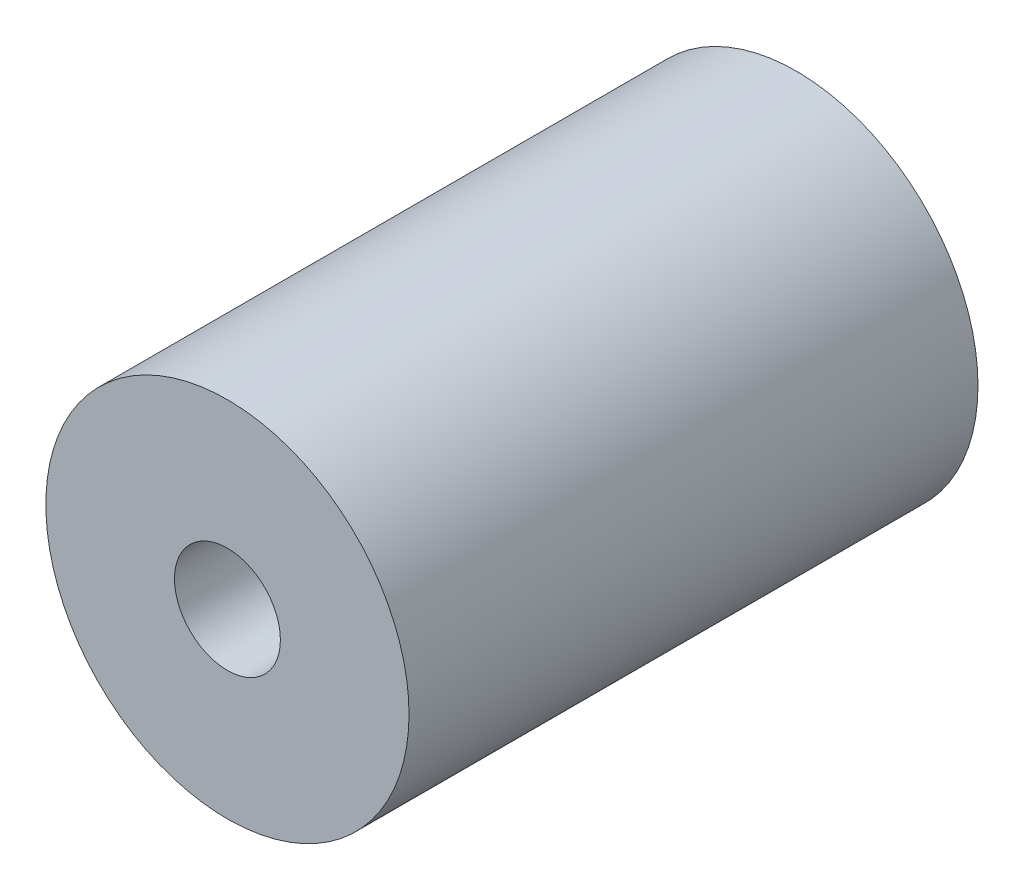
ISO-10303-21;
HEADER;
FILE_DESCRIPTION(('STEP AP214'),'2;1');
FILE_NAME('part.step','',(''),(''),'','','');
FILE_SCHEMA(('AUTOMOTIVE_DESIGN { 1 0 10303 214 1 1 1 1 }'));
ENDSEC;
DATA;
#1=APPLICATION_CONTEXT('core data for automotive mechanical design processes');
#2=APPLICATION_PROTOCOL_DEFINITION('international standard','automotive_design',2000,#1);
#3=PRODUCT_CONTEXT('',#1,'mechanical');
#4=PRODUCT('Part','Part','',(#3));
#5=PRODUCT_RELATED_PRODUCT_CATEGORY('part','',(#4));
#6=PRODUCT_DEFINITION_FORMATION('','',#4);
#7=PRODUCT_DEFINITION_CONTEXT('part definition',#1,'design');
#8=PRODUCT_DEFINITION('design','',#6,#7);
#9=PRODUCT_DEFINITION_SHAPE('','',#8);
#10=(LENGTH_UNIT() NAMED_UNIT(*) SI_UNIT(.MILLI.,.METRE.));
#11=(NAMED_UNIT(*) PLANE_ANGLE_UNIT() SI_UNIT($,.RADIAN.));
#12=(NAMED_UNIT(*) SI_UNIT($,.STERADIAN.) SOLID_ANGLE_UNIT());
#13=UNCERTAINTY_MEASURE_WITH_UNIT(LENGTH_MEASURE(1.E-05),#10,'distance_accuracy_value','');
#14=(GEOMETRIC_REPRESENTATION_CONTEXT(3) GLOBAL_UNCERTAINTY_ASSIGNED_CONTEXT((#13)) GLOBAL_UNIT_ASSIGNED_CONTEXT((#10,
#11,#12)) REPRESENTATION_CONTEXT('',''));
#15=CARTESIAN_POINT('',(0.,0.,0.));
#16=DIRECTION('',(0.,0.,1.));
#17=DIRECTION('',(1.,0.,0.));
#18=AXIS2_PLACEMENT_3D('',#15,#16,#17);
#19=CARTESIAN_POINT('',(0.,0.,18.8));
#20=DIRECTION('',(0.,0.,1.));
#21=DIRECTION('',(1.,0.,0.));
#22=AXIS2_PLACEMENT_3D('',#19,#20,#21);
#23=PLANE('',#22);
#24=CARTESIAN_POINT('',(0.,0.,18.8));
#25=DIRECTION('',(0.,0.,1.));
#26=DIRECTION('',(1.,0.,0.));
#27=AXIS2_PLACEMENT_3D('',#24,#25,#26);
#28=CIRCLE('',#27,6.);
#29=CARTESIAN_POINT('',(6.,0.,18.8));
#30=VERTEX_POINT('',#29);
#31=EDGE_CURVE('E10',#30,#30,#28,.T.);
#32=ORIENTED_EDGE('',*,*,#31,.T.);
#33=EDGE_LOOP('',(#32));
#34=FACE_BOUND('',#33,.T.);
#35=CARTESIAN_POINT('',(0.,0.,18.8));
#36=DIRECTION('',(0.,0.,1.));
#37=DIRECTION('',(1.,0.,0.));
#38=AXIS2_PLACEMENT_3D('',#35,#36,#37);
#39=CIRCLE('',#38,1.75);
#40=CARTESIAN_POINT('',(1.75,0.,18.8));
#41=VERTEX_POINT('',#40);
#42=EDGE_CURVE('E41',#41,#41,#39,.T.);
#43=ORIENTED_EDGE('',*,*,#42,.F.);
#44=EDGE_LOOP('',(#43));
#45=FACE_BOUND('',#44,.T.);
#46=ADVANCED_FACE('F30',(#34,#45),#23,.T.);
#47=CARTESIAN_POINT('',(0.,0.,0.));
#48=DIRECTION('',(0.,0.,1.));
#49=DIRECTION('',(1.,0.,0.));
#50=AXIS2_PLACEMENT_3D('',#47,#48,#49);
#51=PLANE('',#50);
#52=CARTESIAN_POINT('',(0.,0.,0.));
#53=DIRECTION('',(0.,0.,1.));
#54=DIRECTION('',(1.,0.,0.));
#55=AXIS2_PLACEMENT_3D('',#52,#53,#54);
#56=CIRCLE('',#55,6.);
#57=CARTESIAN_POINT('',(6.,0.,0.));
#58=VERTEX_POINT('',#57);
#59=EDGE_CURVE('E34',#58,#58,#56,.T.);
#60=ORIENTED_EDGE('',*,*,#59,.F.);
#61=EDGE_LOOP('',(#60));
#62=FACE_BOUND('',#61,.T.);
#63=CARTESIAN_POINT('',(0.,0.,0.));
#64=DIRECTION('',(0.,0.,1.));
#65=DIRECTION('',(1.,0.,0.));
#66=AXIS2_PLACEMENT_3D('',#63,#64,#65);
#67=CIRCLE('',#66,1.75);
#68=CARTESIAN_POINT('',(1.75,0.,0.));
#69=VERTEX_POINT('',#68);
#70=EDGE_CURVE('E43',#69,#69,#67,.T.);
#71=ORIENTED_EDGE('',*,*,#70,.T.);
#72=EDGE_LOOP('',(#71));
#73=FACE_BOUND('',#72,.T.);
#74=ADVANCED_FACE('F53',(#62,#73),#51,.F.);
#75=CARTESIAN_POINT('',(0.,0.,18.8));
#76=DIRECTION('',(0.,0.,-1.));
#77=DIRECTION('',(-1.,0.,0.));
#78=AXIS2_PLACEMENT_3D('',#75,#76,#77);
#79=CYLINDRICAL_SURFACE('',#78,6.);
#80=ORIENTED_EDGE('',*,*,#31,.F.);
#81=EDGE_LOOP('',(#80));
#82=FACE_BOUND('',#81,.T.);
#83=ORIENTED_EDGE('',*,*,#59,.T.);
#84=EDGE_LOOP('',(#83));
#85=FACE_BOUND('',#84,.T.);
#86=ADVANCED_FACE('F32',(#82,#85),#79,.T.);
#87=CARTESIAN_POINT('',(0.,0.,18.8));
#88=DIRECTION('',(0.,0.,-1.));
#89=DIRECTION('',(-1.,0.,0.));
#90=AXIS2_PLACEMENT_3D('',#87,#88,#89);
#91=CYLINDRICAL_SURFACE('',#90,1.75);
#92=ORIENTED_EDGE('',*,*,#42,.T.);
#93=EDGE_LOOP('',(#92));
#94=FACE_BOUND('',#93,.T.);
#95=ORIENTED_EDGE('',*,*,#70,.F.);
#96=EDGE_LOOP('',(#95));
#97=FACE_BOUND('',#96,.T.);
#98=ADVANCED_FACE('F49',(#94,#97),#91,.F.);
#99=CLOSED_SHELL('',(#46,#74,#86,#98));
#100=MANIFOLD_SOLID_BREP('B2',#99);
#101=ADVANCED_BREP_SHAPE_REPRESENTATION('',(#18,#100),#14);
#102=SHAPE_DEFINITION_REPRESENTATION(#9,#101);
ENDSEC;
END-ISO-10303-21;
